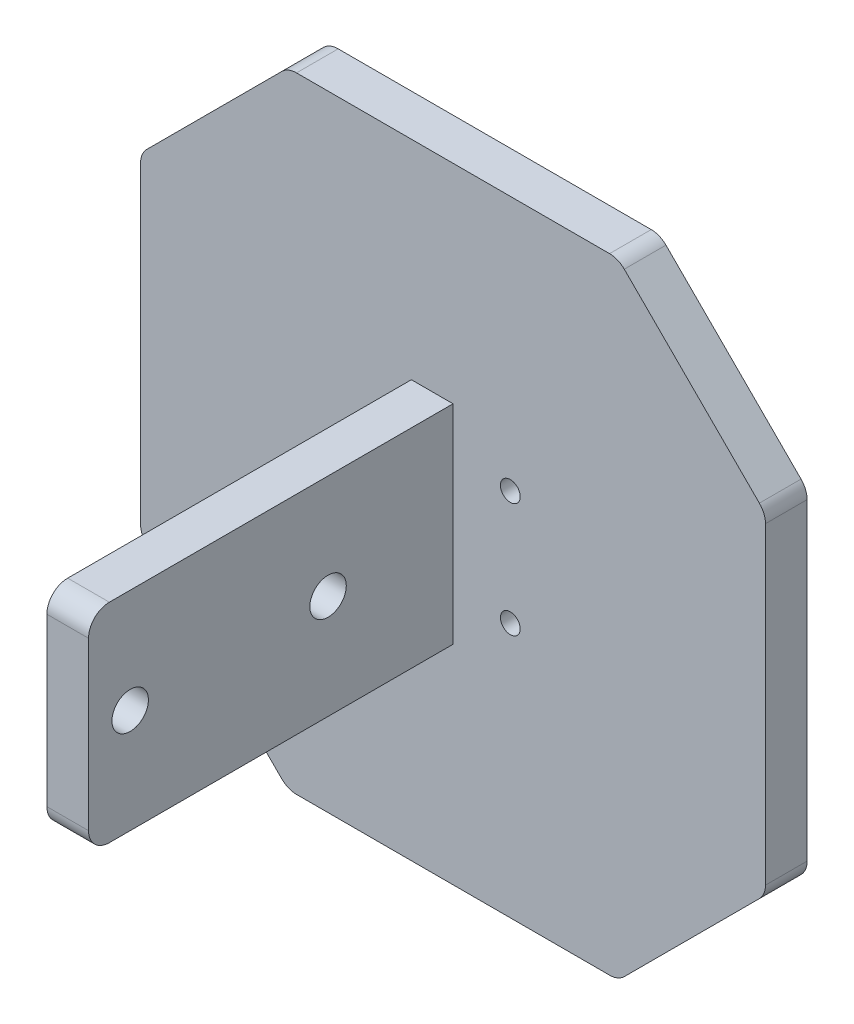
from build123d import *

# Parameters (mm, degrees)
ESQUISSE1_R             = 0.95
BOSS_EXTRU_1_DEPTH      = 4
ESQUISSE2_W             = 4
ESQUISSE2_H             = 20
BOSS_EXTRU_2_DEPTH      = 35
ESQUISSE3_R             = 1.75
ENL_V_MAT_EXTRU_1_DEPTH = 58.628118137
CONG_1_R                = 2
CONG_2_R                = 2


with BuildPart() as part:
    # Esquisse1 → Boss.-Extru.1 (new body)
    with BuildSketch(Plane.XY):
        Polygon((-15.857864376, 30), (15.857864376, 30), (30, 15.857864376), (30, -15.857864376), (15.857864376, -30), (-15.857864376, -30), (-30, -15.857864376), (-30, 15.857864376), align=None)
        with Locations((5.5, 5.5)):
            Circle(ESQUISSE1_R, mode=Mode.SUBTRACT)
        with Locations((5.5, -5.5)):
            Circle(ESQUISSE1_R, mode=Mode.SUBTRACT)
        with BuildLine():
            ThreePointArc((-5.5, 4.55), (-4.55, 5.5), (-5.5, 6.45))
            ThreePointArc((-5.5, 6.45), (-6.45, 5.5), (-5.5, 4.55))
        make_face(mode=Mode.SUBTRACT)
        with BuildLine():
            ThreePointArc((-5.5, -6.45), (-4.55, -5.5), (-5.5, -4.55))
            ThreePointArc((-5.5, -4.55), (-6.45, -5.5), (-5.5, -6.45))
        make_face(mode=Mode.SUBTRACT)
    extrude(amount=BOSS_EXTRU_1_DEPTH)

    # Esquisse2 → Boss.-Extru.2 (add)
    with BuildSketch(Plane.XY.offset(4)):
        with Locations((-2, 0)):
            Rectangle(ESQUISSE2_W, ESQUISSE2_H)
    extrude(amount=BOSS_EXTRU_2_DEPTH)

    # Esquisse3 → Enl_v. mat.-Extru.1 (cut, through all)
    with BuildSketch(Plane(origin=(0, 0, 0), x_dir=(0, 0, -1), z_dir=(1, 0, 0))):
        with Locations((-16, 0)):
            Circle(ESQUISSE3_R)
        with Locations((-35, 0)):
            Circle(ESQUISSE3_R)
    extrude(amount=-ENL_V_MAT_EXTRU_1_DEPTH, mode=Mode.SUBTRACT)

    # Cong_1
    cong_1_edges = [part.edges().sort_by_distance(p)[0] for p in [
        (-2, -10, 39),
        (-2, 10, 39),
    ]]
    fillet(cong_1_edges, radius=CONG_1_R)

    # Cong_2
    cong_2_edges = [part.edges().sort_by_distance(p)[0] for p in [
        (30, 15.857864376, 2),
        (30, -15.857864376, 2),
        (15.857864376, -30, 2),
        (-15.857864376, -30, 2),
        (-30, -15.857864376, 2),
        (-30, 15.857864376, 2),
        (-15.857864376, 30, 2),
        (15.857864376, 30, 2),
    ]]
    fillet(cong_2_edges, radius=CONG_2_R)


solid = part.part
